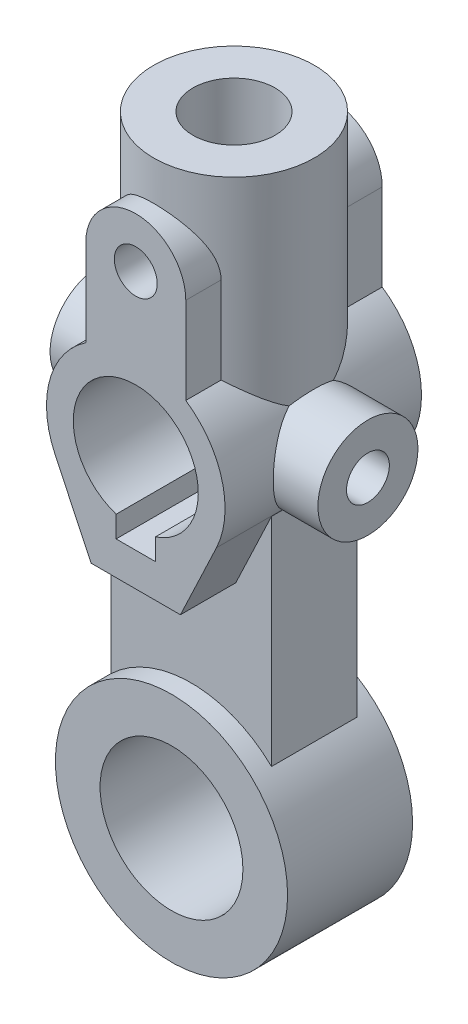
from build123d import *

# Parameters (mm, degrees)
BOSS_EXTRUDE1_DEPTH      = 27.5
SKETCH_FRONT_3_R         = 32.5
SKETCH_FRONT_3_R_2       = 20
BOSS_EXTRUDE2_DEPTH      = 17.5
BOSS_EXTRUDE3_REACH      = 136.42
BOSS_EXTRUDE3_END_RADIUS = 32.5
SKETCH_TOP_W             = 45
SKETCH_TOP_H             = 24
SKETCH_TOP_3_R           = 22.5
BOSS_EXTRUDE4_DEPTH      = 70
SKETCH_RIGHT_R           = 14
BOSS_EXTRUDE5_DEPTH      = 37.5
CUT_EXTRUDE1_DEPTH       = 136.715695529
CUT_EXTRUDE1_DEPTH_BACK  = 136.715695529
SKETCH_FRONT_4_R         = 6
CUT_EXTRUDE2_DEPTH       = 136.715695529
CUT_EXTRUDE2_DEPTH_BACK  = 136.715695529
SKETCH_RIGHT_3_R         = 6
SKETCH_TOP_4_R           = 11.5
CUT_EXTRUDE3_DEPTH       = 136.715695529


with BuildPart() as part:
    # Sketch_Front → Boss-Extrude1 (new, symmetric)
    with BuildSketch(Plane.XY):
        with BuildLine():
            Line((14, 20.712315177), (14, 45))
            ThreePointArc((14, 45), (0, 59), (-14, 45))
            Line((-14, 45), (-14, 20.712315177))
            ThreePointArc((-14, 20.712315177), (-24.114680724, 6.594101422), (-22.59139561, -10.70648609))
            Line((-22.59139561, -10.70648609), (-12.5, -32))
            Line((-12.5, -32), (12.5, -32))
            Line((12.5, -32), (22.59139561, -10.70648609))
            ThreePointArc((22.59139561, -10.70648609), (24.114680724, 6.594101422), (14, 20.712315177))
        make_face()
    extrude(amount=BOSS_EXTRUDE1_DEPTH, both=True)



with BuildPart() as body_2:
    # Sketch_Front_3 → Boss-Extrude2 (new, symmetric)
    with BuildSketch(Plane.XY):
        with Locations((0, -95)):
            Circle(SKETCH_FRONT_3_R)
        with Locations((0, -95)):
            Circle(SKETCH_FRONT_3_R_2, mode=Mode.SUBTRACT)
    extrude(amount=BOSS_EXTRUDE2_DEPTH, both=True)


with BuildPart() as part_1:
    add(part.part)

    add(body_2.part)  # Boss-Extrude3 merges body 2
    # Boss-Extrude3: up to this cylinder (the profile starts outside it)
    boss_extrude3_end = Plane(origin=(0, -95, 0), z_dir=(0, 0, -1)) * Cylinder(BOSS_EXTRUDE3_END_RADIUS, 338.84, mode=Mode.PRIVATE)
    # Sketch_Top → Boss-Extrude3 (add, up to the surface)
    with BuildSketch(Plane(origin=(0, 0, 0), x_dir=(1, 0, 0), z_dir=(0, 1, 0)), mode=Mode.PRIVATE) as boss_extrude3_sk1:
        Rectangle(SKETCH_TOP_W, SKETCH_TOP_H)
    boss_extrude3_tool1 = extrude(boss_extrude3_sk1.sketch, amount=-BOSS_EXTRUDE3_REACH, mode=Mode.PRIVATE) - boss_extrude3_end
    add(boss_extrude3_tool1.solids().sort_by_distance((0, 0, 0))[0])

    # Sketch_Top_3 → Boss-Extrude4 (add)
    with BuildSketch(Plane(origin=(0, 0, 0), x_dir=(1, 0, 0), z_dir=(0, 1, 0))):
        with Locations(Location((0, 0, 0), (0, 0, 51.521405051))):
            Circle(SKETCH_TOP_3_R)
    extrude(amount=BOSS_EXTRUDE4_DEPTH)

    # Sketch_Right → Boss-Extrude5 (add, symmetric)
    with BuildSketch(Plane(origin=(0, 0, 0), x_dir=(0, 0, -1), z_dir=(1, 0, 0))):
        with Locations(Location((0, 0, 0), (0, 0, 229.884667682))):
            Circle(SKETCH_RIGHT_R)
    extrude(amount=BOSS_EXTRUDE5_DEPTH, both=True)

    # Sketch_Front_4 → Cut-Extrude1 (cut, two sides: drawn at the far end of the back side and taken through both)
    with BuildSketch(Plane.XY.offset(-CUT_EXTRUDE1_DEPTH_BACK)):
        with BuildLine():
            Line((5.5, -22.613247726), (5.5, -16.613247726))
            ThreePointArc((5.5, -16.613247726), (0, 17.5), (-5.5, -16.613247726))
            Line((-5.5, -16.613247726), (-5.5, -22.613247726))
            Line((-5.5, -22.613247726), (5.5, -22.613247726))
        make_face()
        with Locations((0, 45)):
            Circle(SKETCH_FRONT_4_R)
    extrude(amount=CUT_EXTRUDE1_DEPTH + CUT_EXTRUDE1_DEPTH_BACK, mode=Mode.SUBTRACT)

    # Sketch_Right_3 → Cut-Extrude2 (cut, two sides: drawn at the far end of the back side and taken through both)
    with BuildSketch(Plane(origin=(0, 0, 0), x_dir=(0, 0, -1), z_dir=(1, 0, 0)).offset(-CUT_EXTRUDE2_DEPTH_BACK)):
        Circle(SKETCH_RIGHT_3_R)
    extrude(amount=CUT_EXTRUDE2_DEPTH + CUT_EXTRUDE2_DEPTH_BACK, mode=Mode.SUBTRACT)

    # Sketch_Top_4 → Cut-Extrude3 (cut, through all)
    with BuildSketch(Plane(origin=(0, 0, 0), x_dir=(1, 0, 0), z_dir=(0, 1, 0))):
        with Locations(Location((0, 0, 0), (0, 0, 90))):
            Circle(SKETCH_TOP_4_R)
    extrude(amount=CUT_EXTRUDE3_DEPTH, mode=Mode.SUBTRACT)


solid = part_1.part
